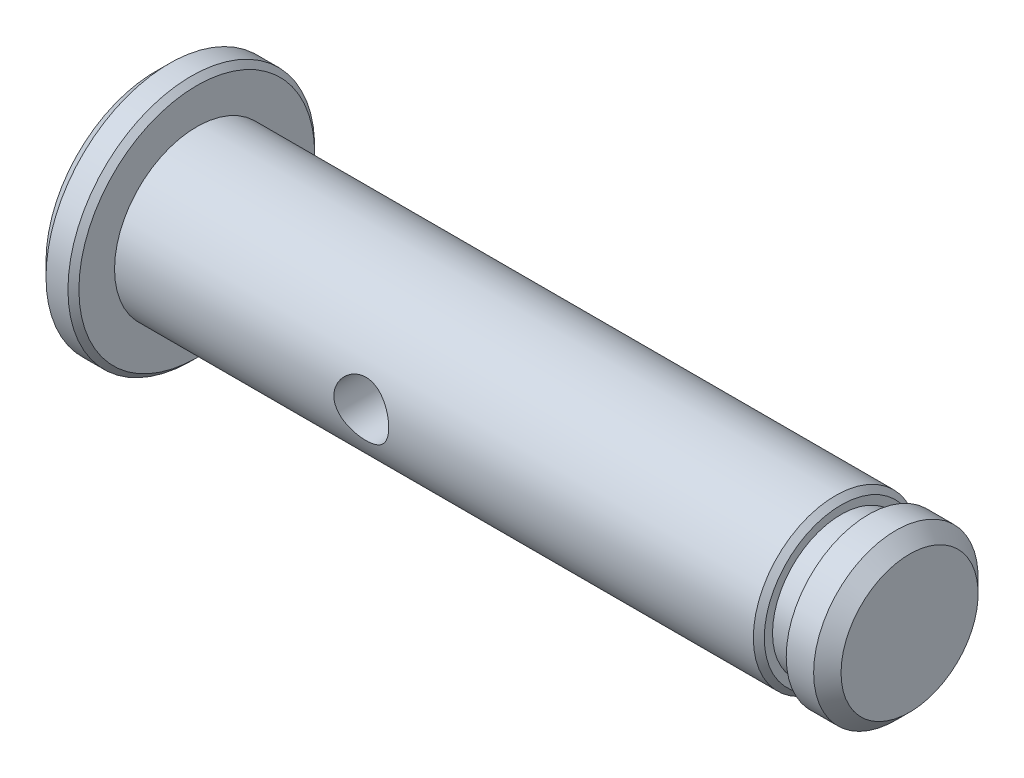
ISO-10303-21;
HEADER;
FILE_DESCRIPTION(('STEP AP214'),'2;1');
FILE_NAME('part.step','',(''),(''),'','','');
FILE_SCHEMA(('AUTOMOTIVE_DESIGN { 1 0 10303 214 1 1 1 1 }'));
ENDSEC;
DATA;
#1=APPLICATION_CONTEXT('core data for automotive mechanical design processes');
#2=APPLICATION_PROTOCOL_DEFINITION('international standard','automotive_design',2000,#1);
#3=PRODUCT_CONTEXT('',#1,'mechanical');
#4=PRODUCT('Part','Part','',(#3));
#5=PRODUCT_RELATED_PRODUCT_CATEGORY('part','',(#4));
#6=PRODUCT_DEFINITION_FORMATION('','',#4);
#7=PRODUCT_DEFINITION_CONTEXT('part definition',#1,'design');
#8=PRODUCT_DEFINITION('design','',#6,#7);
#9=PRODUCT_DEFINITION_SHAPE('','',#8);
#10=(LENGTH_UNIT() NAMED_UNIT(*) SI_UNIT(.MILLI.,.METRE.));
#11=(NAMED_UNIT(*) PLANE_ANGLE_UNIT() SI_UNIT($,.RADIAN.));
#12=(NAMED_UNIT(*) SI_UNIT($,.STERADIAN.) SOLID_ANGLE_UNIT());
#13=UNCERTAINTY_MEASURE_WITH_UNIT(LENGTH_MEASURE(1.E-05),#10,'distance_accuracy_value','');
#14=(GEOMETRIC_REPRESENTATION_CONTEXT(3) GLOBAL_UNCERTAINTY_ASSIGNED_CONTEXT((#13)) GLOBAL_UNIT_ASSIGNED_CONTEXT((#10,
#11,#12)) REPRESENTATION_CONTEXT('',''));
#15=CARTESIAN_POINT('',(0.,0.,0.));
#16=DIRECTION('',(0.,0.,1.));
#17=DIRECTION('',(1.,0.,0.));
#18=AXIS2_PLACEMENT_3D('',#15,#16,#17);
#19=CARTESIAN_POINT('',(0.,0.,0.));
#20=DIRECTION('',(1.,0.,0.));
#21=DIRECTION('',(0.,0.,-1.));
#22=AXIS2_PLACEMENT_3D('',#19,#20,#21);
#23=PLANE('',#22);
#24=CARTESIAN_POINT('',(0.,0.,0.));
#25=DIRECTION('',(1.,0.,0.));
#26=DIRECTION('',(0.,0.,-1.));
#27=AXIS2_PLACEMENT_3D('',#24,#25,#26);
#28=CIRCLE('',#27,4.);
#29=CARTESIAN_POINT('',(0.,0.,-4.));
#30=VERTEX_POINT('',#29);
#31=EDGE_CURVE('E150',#30,#30,#28,.F.);
#32=ORIENTED_EDGE('',*,*,#31,.T.);
#33=EDGE_LOOP('',(#32));
#34=FACE_BOUND('',#33,.T.);
#35=ADVANCED_FACE('F33',(#34),#23,.F.);
#36=CARTESIAN_POINT('',(0.,0.,0.));
#37=DIRECTION('',(-1.,0.,0.));
#38=DIRECTION('',(0.,0.,1.));
#39=AXIS2_PLACEMENT_3D('',#36,#37,#38);
#40=CYLINDRICAL_SURFACE('',#39,4.5);
#41=CARTESIAN_POINT('',(1.3,0.,0.));
#42=DIRECTION('',(-1.,0.,0.));
#43=DIRECTION('',(0.,0.,1.));
#44=AXIS2_PLACEMENT_3D('',#41,#42,#43);
#45=CIRCLE('',#44,4.5);
#46=CARTESIAN_POINT('',(1.3,0.,4.5));
#47=VERTEX_POINT('',#46);
#48=EDGE_CURVE('E40',#47,#47,#45,.T.);
#49=ORIENTED_EDGE('',*,*,#48,.T.);
#50=EDGE_LOOP('',(#49));
#51=FACE_BOUND('',#50,.T.);
#52=CARTESIAN_POINT('',(0.500000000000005,0.,0.));
#53=DIRECTION('',(1.,0.,0.));
#54=DIRECTION('',(0.,0.,-1.));
#55=AXIS2_PLACEMENT_3D('',#52,#53,#54);
#56=CIRCLE('',#55,4.5);
#57=CARTESIAN_POINT('',(0.500000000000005,0.,-4.5));
#58=VERTEX_POINT('',#57);
#59=EDGE_CURVE('E53',#58,#58,#56,.T.);
#60=ORIENTED_EDGE('',*,*,#59,.T.);
#61=EDGE_LOOP('',(#60));
#62=FACE_BOUND('',#61,.T.);
#63=ADVANCED_FACE('F104',(#51,#62),#40,.T.);
#64=CARTESIAN_POINT('',(1.5,4.5,0.));
#65=DIRECTION('',(-1.,0.,0.));
#66=DIRECTION('',(0.,0.,1.));
#67=AXIS2_PLACEMENT_3D('',#64,#65,#66);
#68=PLANE('',#67);
#69=CARTESIAN_POINT('',(1.5,0.,0.));
#70=DIRECTION('',(-1.,0.,0.));
#71=DIRECTION('',(0.,0.,1.));
#72=AXIS2_PLACEMENT_3D('',#69,#70,#71);
#73=CIRCLE('',#72,4.30000000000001);
#74=CARTESIAN_POINT('',(1.5,0.,4.30000000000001));
#75=VERTEX_POINT('',#74);
#76=EDGE_CURVE('E10',#75,#75,#73,.F.);
#77=ORIENTED_EDGE('',*,*,#76,.T.);
#78=EDGE_LOOP('',(#77));
#79=FACE_BOUND('',#78,.T.);
#80=CARTESIAN_POINT('',(1.5,0.,0.));
#81=DIRECTION('',(-1.,0.,0.));
#82=DIRECTION('',(0.,0.,1.));
#83=AXIS2_PLACEMENT_3D('',#80,#81,#82);
#84=CIRCLE('',#83,3.);
#85=CARTESIAN_POINT('',(1.5,0.,3.));
#86=VERTEX_POINT('',#85);
#87=EDGE_CURVE('E135',#86,#86,#84,.T.);
#88=ORIENTED_EDGE('',*,*,#87,.T.);
#89=EDGE_LOOP('',(#88));
#90=FACE_BOUND('',#89,.T.);
#91=ADVANCED_FACE('F100',(#79,#90),#68,.F.);
#92=CARTESIAN_POINT('',(0.,0.,0.));
#93=DIRECTION('',(-1.,0.,0.));
#94=DIRECTION('',(0.,0.,1.));
#95=AXIS2_PLACEMENT_3D('',#92,#93,#94);
#96=CYLINDRICAL_SURFACE('',#95,3.);
#97=CARTESIAN_POINT('',(24.8,0.,0.));
#98=DIRECTION('',(-1.,0.,0.));
#99=DIRECTION('',(0.,0.,1.));
#100=AXIS2_PLACEMENT_3D('',#97,#98,#99);
#101=CIRCLE('',#100,3.);
#102=CARTESIAN_POINT('',(24.8,0.,3.));
#103=VERTEX_POINT('',#102);
#104=EDGE_CURVE('E48',#103,#103,#101,.T.);
#105=ORIENTED_EDGE('',*,*,#104,.T.);
#106=EDGE_LOOP('',(#105));
#107=FACE_BOUND('',#106,.T.);
#108=CARTESIAN_POINT('',(11.5,0.,3.));
#109=CARTESIAN_POINT('',(11.5000002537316,-0.0545633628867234,3.00000015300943));
#110=CARTESIAN_POINT('',(11.4955197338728,-0.10912519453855,2.99849769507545));
#111=CARTESIAN_POINT('',(11.4777708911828,-0.216641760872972,2.99265210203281));
#112=CARTESIAN_POINT('',(11.4645016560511,-0.269596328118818,2.98830867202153));
#113=CARTESIAN_POINT('',(11.429680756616,-0.372332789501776,2.97725307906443));
#114=CARTESIAN_POINT('',(11.4081429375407,-0.422119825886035,2.97054487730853));
#115=CARTESIAN_POINT('',(11.3574588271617,-0.517374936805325,2.95544445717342));
#116=CARTESIAN_POINT('',(11.3283110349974,-0.562842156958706,2.94705190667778));
#117=CARTESIAN_POINT('',(11.2621741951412,-0.649741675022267,2.92914094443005));
#118=CARTESIAN_POINT('',(11.2249687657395,-0.691003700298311,2.91959556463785));
#119=CARTESIAN_POINT('',(11.1442328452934,-0.766832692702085,2.90060314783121));
#120=CARTESIAN_POINT('',(11.1007009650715,-0.801398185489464,2.89115613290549));
#121=CARTESIAN_POINT('',(11.0070148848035,-0.86382494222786,2.87313332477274));
#122=CARTESIAN_POINT('',(10.9567062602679,-0.891464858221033,2.86459039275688));
#123=CARTESIAN_POINT('',(10.8518239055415,-0.937818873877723,2.84975305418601));
#124=CARTESIAN_POINT('',(10.7972514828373,-0.956535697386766,2.84345796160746));
#125=CARTESIAN_POINT('',(10.6873267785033,-0.983873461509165,2.83411303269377));
#126=CARTESIAN_POINT('',(10.6320627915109,-0.992813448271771,2.83096095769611));
#127=CARTESIAN_POINT('',(10.5207362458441,-1.00134112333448,2.82795656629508));
#128=CARTESIAN_POINT('',(10.4646739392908,-1.00093170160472,2.8281032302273));
#129=CARTESIAN_POINT('',(10.356063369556,-0.99101990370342,2.8315901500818));
#130=CARTESIAN_POINT('',(10.303471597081,-0.981933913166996,2.83478415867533));
#131=CARTESIAN_POINT('',(10.2006065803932,-0.955606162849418,2.84376657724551));
#132=CARTESIAN_POINT('',(10.1503336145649,-0.938363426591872,2.84955529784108));
#133=CARTESIAN_POINT('',(10.0525872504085,-0.895939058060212,2.86317911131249));
#134=CARTESIAN_POINT('',(10.0051719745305,-0.870634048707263,2.87104565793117));
#135=CARTESIAN_POINT('',(9.91512909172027,-0.81288910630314,2.88792558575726));
#136=CARTESIAN_POINT('',(9.87250287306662,-0.780447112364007,2.89693929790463));
#137=CARTESIAN_POINT('',(9.79090840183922,-0.707349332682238,2.91567329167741));
#138=CARTESIAN_POINT('',(9.75224730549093,-0.666353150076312,2.92540589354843));
#139=CARTESIAN_POINT('',(9.6822687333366,-0.578339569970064,2.94406938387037));
#140=CARTESIAN_POINT('',(9.6509519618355,-0.531321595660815,2.95300019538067));
#141=CARTESIAN_POINT('',(9.59630369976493,-0.431947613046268,2.96917107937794));
#142=CARTESIAN_POINT('',(9.57305450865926,-0.379543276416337,2.97639350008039));
#143=CARTESIAN_POINT('',(9.53579682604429,-0.271269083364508,2.98820567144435));
#144=CARTESIAN_POINT('',(9.52178512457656,-0.215400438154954,2.99279633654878));
#145=CARTESIAN_POINT('',(9.50394433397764,-0.104383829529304,2.99867627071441));
#146=CARTESIAN_POINT('',(9.49970019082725,-0.0493095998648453,3.00010001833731));
#147=CARTESIAN_POINT('',(9.50033267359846,0.0607750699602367,2.99988902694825));
#148=CARTESIAN_POINT('',(9.50520775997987,0.115785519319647,2.99825480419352));
#149=CARTESIAN_POINT('',(9.52361190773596,0.22251986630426,2.99220024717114));
#150=CARTESIAN_POINT('',(9.53688620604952,0.274292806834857,2.98786198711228));
#151=CARTESIAN_POINT('',(9.5713934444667,0.374855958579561,2.97691846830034));
#152=CARTESIAN_POINT('',(9.59262739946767,0.42364578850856,2.97031292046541));
#153=CARTESIAN_POINT('',(9.6430704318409,0.518288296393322,2.95528931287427));
#154=CARTESIAN_POINT('',(9.6724745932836,0.564029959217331,2.94682814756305));
#155=CARTESIAN_POINT('',(9.73819415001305,0.650064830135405,2.92905253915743));
#156=CARTESIAN_POINT('',(9.77451165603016,0.690356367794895,2.91973783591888));
#157=CARTESIAN_POINT('',(9.85497875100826,0.766252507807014,2.90076847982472));
#158=CARTESIAN_POINT('',(9.89940922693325,0.801560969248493,2.89111761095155));
#159=CARTESIAN_POINT('',(9.9937715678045,0.864257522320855,2.87299973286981));
#160=CARTESIAN_POINT('',(10.0437034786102,0.891645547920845,2.8645327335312));
#161=CARTESIAN_POINT('',(10.1476730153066,0.937596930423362,2.84982391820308));
#162=CARTESIAN_POINT('',(10.2017020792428,0.956178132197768,2.84357760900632));
#163=CARTESIAN_POINT('',(10.3123786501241,0.983894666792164,2.83410832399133));
#164=CARTESIAN_POINT('',(10.3690249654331,0.993034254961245,2.83088398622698));
#165=CARTESIAN_POINT('',(10.4801970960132,1.00127628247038,2.82797858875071));
#166=CARTESIAN_POINT('',(10.5346823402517,1.00087025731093,2.82812400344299));
#167=CARTESIAN_POINT('',(10.6427650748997,0.991242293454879,2.8315126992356));
#168=CARTESIAN_POINT('',(10.6963626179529,0.982020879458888,2.83475579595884));
#169=CARTESIAN_POINT('',(10.8001356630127,0.955371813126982,2.84384524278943));
#170=CARTESIAN_POINT('',(10.8503568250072,0.938103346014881,2.84964098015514));
#171=CARTESIAN_POINT('',(10.9472274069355,0.895979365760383,2.86316398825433));
#172=CARTESIAN_POINT('',(10.9938760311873,0.871122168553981,2.87089168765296));
#173=CARTESIAN_POINT('',(11.0844836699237,0.813260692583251,2.8878282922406));
#174=CARTESIAN_POINT('',(11.1282365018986,0.779948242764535,2.89708711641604));
#175=CARTESIAN_POINT('',(11.209689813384,0.706642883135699,2.91583356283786));
#176=CARTESIAN_POINT('',(11.247388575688,0.666648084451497,2.92532124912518));
#177=CARTESIAN_POINT('',(11.3171444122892,0.579241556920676,2.94390030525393));
#178=CARTESIAN_POINT('',(11.348924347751,0.531601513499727,2.95296181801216));
#179=CARTESIAN_POINT('',(11.4039904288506,0.43135735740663,2.96925991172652));
#180=CARTESIAN_POINT('',(11.427278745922,0.37875451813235,2.9764969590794));
#181=CARTESIAN_POINT('',(11.4637216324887,0.272493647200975,2.98805515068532));
#182=CARTESIAN_POINT('',(11.4772824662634,0.218987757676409,2.9924921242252));
#183=CARTESIAN_POINT('',(11.4954202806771,0.110320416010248,2.99846407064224));
#184=CARTESIAN_POINT('',(11.4999997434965,0.0551594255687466,2.99999984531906));
#185=CARTESIAN_POINT('',(11.5,0.,3.));
#186=B_SPLINE_CURVE_WITH_KNOTS('',3,(#108,#109,#110,#111,#112,#113,#114,#115,#116,#117,#118,
#119,#120,#121,#122,#123,#124,#125,#126,#127,#128,#129,#130,#131,#132,#133,#134,#135,#136,#137,
#138,#139,#140,#141,#142,#143,#144,#145,#146,#147,#148,#149,#150,#151,#152,#153,#154,#155,#156,
#157,#158,#159,#160,#161,#162,#163,#164,#165,#166,#167,#168,#169,#170,#171,#172,#173,#174,#175,
#176,#177,#178,#179,#180,#181,#182,#183,#184,#185),.UNSPECIFIED.,.T.,.F.,(4,2,2,2,2,2,2,2,2,2,2,
2,2,2,2,2,2,2,2,2,2,2,2,2,2,2,2,2,2,2,2,2,2,2,2,2,2,2,4),(0.,0.163487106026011,
0.326991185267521,0.490222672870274,0.653486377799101,0.821846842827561,0.990244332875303,
1.16348384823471,1.33667044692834,1.5040192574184,1.67131633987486,1.83096826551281,
1.99063930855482,2.15288171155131,2.31517102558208,2.48593305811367,2.65671145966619,
2.82918405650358,3.00159668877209,3.1665358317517,3.33144713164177,3.49158157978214,
3.65173645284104,3.81610399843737,3.98052180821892,4.15241022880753,4.32430008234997,
4.49584013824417,4.66730284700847,4.82995666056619,4.99260079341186,5.15215587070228,
5.31174638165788,5.47830066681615,5.6449021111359,5.81799660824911,5.99104681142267,
6.15636558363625,6.32163866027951),.UNSPECIFIED.);
#187=CARTESIAN_POINT('',(11.5,0.,3.));
#188=VERTEX_POINT('',#187);
#189=EDGE_CURVE('E54',#188,#188,#186,.T.);
#190=ORIENTED_EDGE('',*,*,#189,.T.);
#191=EDGE_LOOP('',(#190));
#192=FACE_BOUND('',#191,.T.);
#193=CARTESIAN_POINT('',(11.5,0.,-3.));
#194=CARTESIAN_POINT('',(11.5000002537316,0.0545633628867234,-3.00000015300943));
#195=CARTESIAN_POINT('',(11.4955197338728,0.10912519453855,-2.99849769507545));
#196=CARTESIAN_POINT('',(11.4777708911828,0.216641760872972,-2.99265210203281));
#197=CARTESIAN_POINT('',(11.4645016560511,0.269596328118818,-2.98830867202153));
#198=CARTESIAN_POINT('',(11.429680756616,0.372332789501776,-2.97725307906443));
#199=CARTESIAN_POINT('',(11.4081429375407,0.422119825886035,-2.97054487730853));
#200=CARTESIAN_POINT('',(11.3574588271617,0.517374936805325,-2.95544445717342));
#201=CARTESIAN_POINT('',(11.3283110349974,0.562842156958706,-2.94705190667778));
#202=CARTESIAN_POINT('',(11.2621741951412,0.649741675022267,-2.92914094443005));
#203=CARTESIAN_POINT('',(11.2249687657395,0.691003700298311,-2.91959556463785));
#204=CARTESIAN_POINT('',(11.1442328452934,0.766832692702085,-2.90060314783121));
#205=CARTESIAN_POINT('',(11.1007009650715,0.801398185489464,-2.89115613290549));
#206=CARTESIAN_POINT('',(11.0070148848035,0.86382494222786,-2.87313332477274));
#207=CARTESIAN_POINT('',(10.9567062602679,0.891464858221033,-2.86459039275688));
#208=CARTESIAN_POINT('',(10.8518239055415,0.937818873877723,-2.84975305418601));
#209=CARTESIAN_POINT('',(10.7972514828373,0.956535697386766,-2.84345796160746));
#210=CARTESIAN_POINT('',(10.6873267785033,0.983873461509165,-2.83411303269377));
#211=CARTESIAN_POINT('',(10.6320627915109,0.992813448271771,-2.83096095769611));
#212=CARTESIAN_POINT('',(10.5207362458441,1.00134112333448,-2.82795656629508));
#213=CARTESIAN_POINT('',(10.4646739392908,1.00093170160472,-2.8281032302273));
#214=CARTESIAN_POINT('',(10.356063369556,0.99101990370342,-2.8315901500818));
#215=CARTESIAN_POINT('',(10.303471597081,0.981933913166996,-2.83478415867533));
#216=CARTESIAN_POINT('',(10.2006065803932,0.955606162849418,-2.84376657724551));
#217=CARTESIAN_POINT('',(10.1503336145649,0.938363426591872,-2.84955529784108));
#218=CARTESIAN_POINT('',(10.0525872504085,0.895939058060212,-2.86317911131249));
#219=CARTESIAN_POINT('',(10.0051719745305,0.870634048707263,-2.87104565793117));
#220=CARTESIAN_POINT('',(9.91512909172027,0.81288910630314,-2.88792558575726));
#221=CARTESIAN_POINT('',(9.87250287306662,0.780447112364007,-2.89693929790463));
#222=CARTESIAN_POINT('',(9.79090840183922,0.707349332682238,-2.91567329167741));
#223=CARTESIAN_POINT('',(9.75224730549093,0.666353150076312,-2.92540589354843));
#224=CARTESIAN_POINT('',(9.6822687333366,0.578339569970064,-2.94406938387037));
#225=CARTESIAN_POINT('',(9.6509519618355,0.531321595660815,-2.95300019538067));
#226=CARTESIAN_POINT('',(9.59630369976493,0.431947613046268,-2.96917107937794));
#227=CARTESIAN_POINT('',(9.57305450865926,0.379543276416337,-2.97639350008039));
#228=CARTESIAN_POINT('',(9.53579682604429,0.271269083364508,-2.98820567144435));
#229=CARTESIAN_POINT('',(9.52178512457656,0.215400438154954,-2.99279633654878));
#230=CARTESIAN_POINT('',(9.50394433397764,0.104383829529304,-2.99867627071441));
#231=CARTESIAN_POINT('',(9.49970019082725,0.0493095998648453,-3.00010001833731));
#232=CARTESIAN_POINT('',(9.50033267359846,-0.0607750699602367,-2.99988902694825));
#233=CARTESIAN_POINT('',(9.50520775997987,-0.115785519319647,-2.99825480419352));
#234=CARTESIAN_POINT('',(9.52361190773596,-0.22251986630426,-2.99220024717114));
#235=CARTESIAN_POINT('',(9.53688620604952,-0.274292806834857,-2.98786198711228));
#236=CARTESIAN_POINT('',(9.5713934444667,-0.374855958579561,-2.97691846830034));
#237=CARTESIAN_POINT('',(9.59262739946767,-0.42364578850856,-2.97031292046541));
#238=CARTESIAN_POINT('',(9.6430704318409,-0.518288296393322,-2.95528931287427));
#239=CARTESIAN_POINT('',(9.6724745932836,-0.564029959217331,-2.94682814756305));
#240=CARTESIAN_POINT('',(9.73819415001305,-0.650064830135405,-2.92905253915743));
#241=CARTESIAN_POINT('',(9.77451165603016,-0.690356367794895,-2.91973783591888));
#242=CARTESIAN_POINT('',(9.85497875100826,-0.766252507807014,-2.90076847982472));
#243=CARTESIAN_POINT('',(9.89940922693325,-0.801560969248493,-2.89111761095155));
#244=CARTESIAN_POINT('',(9.9937715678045,-0.864257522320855,-2.87299973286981));
#245=CARTESIAN_POINT('',(10.0437034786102,-0.891645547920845,-2.8645327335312));
#246=CARTESIAN_POINT('',(10.1476730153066,-0.937596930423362,-2.84982391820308));
#247=CARTESIAN_POINT('',(10.2017020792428,-0.956178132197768,-2.84357760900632));
#248=CARTESIAN_POINT('',(10.3123786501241,-0.983894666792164,-2.83410832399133));
#249=CARTESIAN_POINT('',(10.3690249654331,-0.993034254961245,-2.83088398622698));
#250=CARTESIAN_POINT('',(10.4801970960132,-1.00127628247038,-2.82797858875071));
#251=CARTESIAN_POINT('',(10.5346823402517,-1.00087025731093,-2.82812400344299));
#252=CARTESIAN_POINT('',(10.6427650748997,-0.991242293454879,-2.8315126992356));
#253=CARTESIAN_POINT('',(10.6963626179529,-0.982020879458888,-2.83475579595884));
#254=CARTESIAN_POINT('',(10.8001356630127,-0.955371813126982,-2.84384524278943));
#255=CARTESIAN_POINT('',(10.8503568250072,-0.938103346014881,-2.84964098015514));
#256=CARTESIAN_POINT('',(10.9472274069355,-0.895979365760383,-2.86316398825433));
#257=CARTESIAN_POINT('',(10.9938760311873,-0.871122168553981,-2.87089168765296));
#258=CARTESIAN_POINT('',(11.0844836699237,-0.813260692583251,-2.8878282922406));
#259=CARTESIAN_POINT('',(11.1282365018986,-0.779948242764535,-2.89708711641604));
#260=CARTESIAN_POINT('',(11.209689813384,-0.706642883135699,-2.91583356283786));
#261=CARTESIAN_POINT('',(11.247388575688,-0.666648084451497,-2.92532124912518));
#262=CARTESIAN_POINT('',(11.3171444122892,-0.579241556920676,-2.94390030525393));
#263=CARTESIAN_POINT('',(11.348924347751,-0.531601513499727,-2.95296181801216));
#264=CARTESIAN_POINT('',(11.4039904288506,-0.43135735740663,-2.96925991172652));
#265=CARTESIAN_POINT('',(11.427278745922,-0.37875451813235,-2.9764969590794));
#266=CARTESIAN_POINT('',(11.4637216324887,-0.272493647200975,-2.98805515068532));
#267=CARTESIAN_POINT('',(11.4772824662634,-0.218987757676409,-2.9924921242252));
#268=CARTESIAN_POINT('',(11.4954202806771,-0.110320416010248,-2.99846407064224));
#269=CARTESIAN_POINT('',(11.4999997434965,-0.0551594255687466,-2.99999984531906));
#270=CARTESIAN_POINT('',(11.5,0.,-3.));
#271=B_SPLINE_CURVE_WITH_KNOTS('',3,(#193,#194,#195,#196,#197,#198,#199,#200,#201,#202,#203,
#204,#205,#206,#207,#208,#209,#210,#211,#212,#213,#214,#215,#216,#217,#218,#219,#220,#221,#222,
#223,#224,#225,#226,#227,#228,#229,#230,#231,#232,#233,#234,#235,#236,#237,#238,#239,#240,#241,
#242,#243,#244,#245,#246,#247,#248,#249,#250,#251,#252,#253,#254,#255,#256,#257,#258,#259,#260,
#261,#262,#263,#264,#265,#266,#267,#268,#269,#270),.UNSPECIFIED.,.T.,.F.,(4,2,2,2,2,2,2,2,2,2,2,
2,2,2,2,2,2,2,2,2,2,2,2,2,2,2,2,2,2,2,2,2,2,2,2,2,2,2,4),(0.,0.163487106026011,
0.326991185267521,0.490222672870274,0.653486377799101,0.821846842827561,0.990244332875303,
1.16348384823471,1.33667044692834,1.5040192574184,1.67131633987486,1.83096826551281,
1.99063930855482,2.15288171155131,2.31517102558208,2.48593305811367,2.65671145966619,
2.82918405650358,3.00159668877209,3.1665358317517,3.33144713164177,3.49158157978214,
3.65173645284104,3.81610399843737,3.98052180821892,4.15241022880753,4.32430008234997,
4.49584013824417,4.66730284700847,4.82995666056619,4.99260079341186,5.15215587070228,
5.31174638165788,5.47830066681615,5.6449021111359,5.81799660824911,5.99104681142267,
6.15636558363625,6.32163866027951),.UNSPECIFIED.);
#272=CARTESIAN_POINT('',(11.5,0.,-3.));
#273=VERTEX_POINT('',#272);
#274=EDGE_CURVE('E62',#273,#273,#271,.T.);
#275=ORIENTED_EDGE('',*,*,#274,.T.);
#276=EDGE_LOOP('',(#275));
#277=FACE_BOUND('',#276,.T.);
#278=ORIENTED_EDGE('',*,*,#87,.F.);
#279=EDGE_LOOP('',(#278));
#280=FACE_BOUND('',#279,.T.);
#281=ADVANCED_FACE('F66',(#107,#192,#277,#280),#96,.T.);
#282=CARTESIAN_POINT('',(25.,3.,0.));
#283=DIRECTION('',(-1.,0.,0.));
#284=DIRECTION('',(0.,0.,1.));
#285=AXIS2_PLACEMENT_3D('',#282,#283,#284);
#286=PLANE('',#285);
#287=CARTESIAN_POINT('',(25.,0.,0.));
#288=DIRECTION('',(-1.,0.,0.));
#289=DIRECTION('',(0.,0.,1.));
#290=AXIS2_PLACEMENT_3D('',#287,#288,#289);
#291=CIRCLE('',#290,2.8);
#292=CARTESIAN_POINT('',(25.,0.,2.8));
#293=VERTEX_POINT('',#292);
#294=EDGE_CURVE('E44',#293,#293,#291,.F.);
#295=ORIENTED_EDGE('',*,*,#294,.T.);
#296=EDGE_LOOP('',(#295));
#297=FACE_BOUND('',#296,.T.);
#298=CARTESIAN_POINT('',(25.,0.,0.));
#299=DIRECTION('',(-1.,0.,0.));
#300=DIRECTION('',(0.,0.,1.));
#301=AXIS2_PLACEMENT_3D('',#298,#299,#300);
#302=CIRCLE('',#301,2.5);
#303=CARTESIAN_POINT('',(25.,0.,2.5));
#304=VERTEX_POINT('',#303);
#305=EDGE_CURVE('E138',#304,#304,#302,.T.);
#306=ORIENTED_EDGE('',*,*,#305,.T.);
#307=EDGE_LOOP('',(#306));
#308=FACE_BOUND('',#307,.T.);
#309=ADVANCED_FACE('F93',(#297,#308),#286,.F.);
#310=CARTESIAN_POINT('',(0.,0.,0.));
#311=DIRECTION('',(-1.,0.,0.));
#312=DIRECTION('',(0.,0.,1.));
#313=AXIS2_PLACEMENT_3D('',#310,#311,#312);
#314=CYLINDRICAL_SURFACE('',#313,2.5);
#315=ORIENTED_EDGE('',*,*,#305,.F.);
#316=EDGE_LOOP('',(#315));
#317=FACE_BOUND('',#316,.T.);
#318=CARTESIAN_POINT('',(26.,0.,0.));
#319=DIRECTION('',(-1.,0.,0.));
#320=DIRECTION('',(0.,0.,1.));
#321=AXIS2_PLACEMENT_3D('',#318,#319,#320);
#322=CIRCLE('',#321,2.5);
#323=CARTESIAN_POINT('',(26.,0.,2.5));
#324=VERTEX_POINT('',#323);
#325=EDGE_CURVE('E144',#324,#324,#322,.T.);
#326=ORIENTED_EDGE('',*,*,#325,.T.);
#327=EDGE_LOOP('',(#326));
#328=FACE_BOUND('',#327,.T.);
#329=ADVANCED_FACE('F90',(#317,#328),#314,.T.);
#330=CARTESIAN_POINT('',(26.,2.5,0.));
#331=DIRECTION('',(1.,0.,0.));
#332=DIRECTION('',(0.,0.,-1.));
#333=AXIS2_PLACEMENT_3D('',#330,#331,#332);
#334=PLANE('',#333);
#335=ORIENTED_EDGE('',*,*,#325,.F.);
#336=EDGE_LOOP('',(#335));
#337=FACE_BOUND('',#336,.T.);
#338=CARTESIAN_POINT('',(26.,0.,0.));
#339=DIRECTION('',(-1.,0.,0.));
#340=DIRECTION('',(0.,0.,1.));
#341=AXIS2_PLACEMENT_3D('',#338,#339,#340);
#342=CIRCLE('',#341,3.);
#343=CARTESIAN_POINT('',(26.,0.,3.));
#344=VERTEX_POINT('',#343);
#345=EDGE_CURVE('E61',#344,#344,#342,.T.);
#346=ORIENTED_EDGE('',*,*,#345,.T.);
#347=EDGE_LOOP('',(#346));
#348=FACE_BOUND('',#347,.T.);
#349=ADVANCED_FACE('F86',(#337,#348),#334,.F.);
#350=CARTESIAN_POINT('',(0.,0.,0.));
#351=DIRECTION('',(-1.,0.,0.));
#352=DIRECTION('',(0.,0.,1.));
#353=AXIS2_PLACEMENT_3D('',#350,#351,#352);
#354=CYLINDRICAL_SURFACE('',#353,3.);
#355=CARTESIAN_POINT('',(27.,0.,0.));
#356=DIRECTION('',(-1.,0.,0.));
#357=DIRECTION('',(0.,0.,1.));
#358=AXIS2_PLACEMENT_3D('',#355,#356,#357);
#359=CIRCLE('',#358,3.);
#360=CARTESIAN_POINT('',(27.,0.,3.));
#361=VERTEX_POINT('',#360);
#362=EDGE_CURVE('E137',#361,#361,#359,.T.);
#363=ORIENTED_EDGE('',*,*,#362,.T.);
#364=EDGE_LOOP('',(#363));
#365=FACE_BOUND('',#364,.T.);
#366=ORIENTED_EDGE('',*,*,#345,.F.);
#367=EDGE_LOOP('',(#366));
#368=FACE_BOUND('',#367,.T.);
#369=ADVANCED_FACE('F82',(#365,#368),#354,.T.);
#370=CARTESIAN_POINT('',(27.5,3.,0.));
#371=DIRECTION('',(-1.,0.,0.));
#372=DIRECTION('',(0.,0.,1.));
#373=AXIS2_PLACEMENT_3D('',#370,#371,#372);
#374=PLANE('',#373);
#375=CARTESIAN_POINT('',(27.5,0.,0.));
#376=DIRECTION('',(-1.,0.,0.));
#377=DIRECTION('',(0.,0.,1.));
#378=AXIS2_PLACEMENT_3D('',#375,#376,#377);
#379=CIRCLE('',#378,2.49999999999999);
#380=CARTESIAN_POINT('',(27.5,0.,2.49999999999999));
#381=VERTEX_POINT('',#380);
#382=EDGE_CURVE('E141',#381,#381,#379,.F.);
#383=ORIENTED_EDGE('',*,*,#382,.T.);
#384=EDGE_LOOP('',(#383));
#385=FACE_BOUND('',#384,.T.);
#386=ADVANCED_FACE('F77',(#385),#374,.F.);
#387=CARTESIAN_POINT('',(27.,0.,0.));
#388=DIRECTION('',(-1.,0.,0.));
#389=DIRECTION('',(0.,0.,1.));
#390=AXIS2_PLACEMENT_3D('',#387,#388,#389);
#391=CONICAL_SURFACE('',#390,3.,0.785398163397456);
#392=ORIENTED_EDGE('',*,*,#382,.F.);
#393=EDGE_LOOP('',(#392));
#394=FACE_BOUND('',#393,.T.);
#395=ORIENTED_EDGE('',*,*,#362,.F.);
#396=EDGE_LOOP('',(#395));
#397=FACE_BOUND('',#396,.T.);
#398=ADVANCED_FACE('F81',(#394,#397),#391,.T.);
#399=CARTESIAN_POINT('',(0.,0.,0.));
#400=DIRECTION('',(1.,0.,0.));
#401=DIRECTION('',(0.,0.,-1.));
#402=AXIS2_PLACEMENT_3D('',#399,#400,#401);
#403=CONICAL_SURFACE('',#402,4.,0.785398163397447);
#404=ORIENTED_EDGE('',*,*,#59,.F.);
#405=EDGE_LOOP('',(#404));
#406=FACE_BOUND('',#405,.T.);
#407=ORIENTED_EDGE('',*,*,#31,.F.);
#408=EDGE_LOOP('',(#407));
#409=FACE_BOUND('',#408,.T.);
#410=ADVANCED_FACE('F75',(#406,#409),#403,.T.);
#411=CARTESIAN_POINT('',(10.5,0.,-15.));
#412=DIRECTION('',(0.,0.,1.));
#413=DIRECTION('',(1.,0.,0.));
#414=AXIS2_PLACEMENT_3D('',#411,#412,#413);
#415=CYLINDRICAL_SURFACE('',#414,1.);
#416=ORIENTED_EDGE('',*,*,#274,.F.);
#417=EDGE_LOOP('',(#416));
#418=FACE_BOUND('',#417,.T.);
#419=ORIENTED_EDGE('',*,*,#189,.F.);
#420=EDGE_LOOP('',(#419));
#421=FACE_BOUND('',#420,.T.);
#422=ADVANCED_FACE('F70',(#418,#421),#415,.F.);
#423=CARTESIAN_POINT('',(24.8,0.,0.));
#424=DIRECTION('',(-1.,0.,0.));
#425=DIRECTION('',(0.,0.,1.));
#426=AXIS2_PLACEMENT_3D('',#423,#424,#425);
#427=CONICAL_SURFACE('',#426,3.,0.78539816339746);
#428=ORIENTED_EDGE('',*,*,#294,.F.);
#429=EDGE_LOOP('',(#428));
#430=FACE_BOUND('',#429,.T.);
#431=ORIENTED_EDGE('',*,*,#104,.F.);
#432=EDGE_LOOP('',(#431));
#433=FACE_BOUND('',#432,.T.);
#434=ADVANCED_FACE('F74',(#430,#433),#427,.T.);
#435=CARTESIAN_POINT('',(1.3,0.,0.));
#436=DIRECTION('',(-1.,0.,0.));
#437=DIRECTION('',(0.,0.,1.));
#438=AXIS2_PLACEMENT_3D('',#435,#436,#437);
#439=CONICAL_SURFACE('',#438,4.5,0.785398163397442);
#440=ORIENTED_EDGE('',*,*,#76,.F.);
#441=EDGE_LOOP('',(#440));
#442=FACE_BOUND('',#441,.T.);
#443=ORIENTED_EDGE('',*,*,#48,.F.);
#444=EDGE_LOOP('',(#443));
#445=FACE_BOUND('',#444,.T.);
#446=ADVANCED_FACE('F35',(#442,#445),#439,.T.);
#447=CLOSED_SHELL('',(#35,#63,#91,#281,#309,#329,#349,#369,#386,#398,#410,#422,#434,#446));
#448=MANIFOLD_SOLID_BREP('B2',#447);
#449=ADVANCED_BREP_SHAPE_REPRESENTATION('',(#18,#448),#14);
#450=SHAPE_DEFINITION_REPRESENTATION(#9,#449);
ENDSEC;
END-ISO-10303-21;
